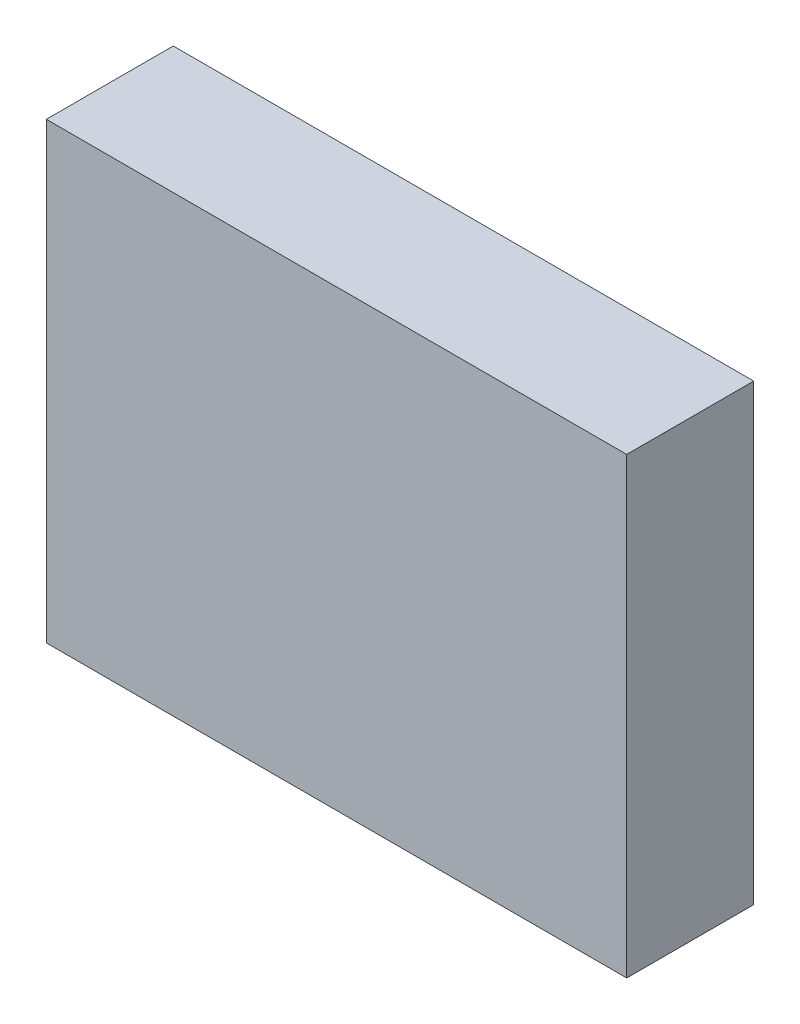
ISO-10303-21;
HEADER;
FILE_DESCRIPTION(('STEP AP214'),'2;1');
FILE_NAME('part.step','',(''),(''),'','','');
FILE_SCHEMA(('AUTOMOTIVE_DESIGN { 1 0 10303 214 1 1 1 1 }'));
ENDSEC;
DATA;
#1=APPLICATION_CONTEXT('core data for automotive mechanical design processes');
#2=APPLICATION_PROTOCOL_DEFINITION('international standard','automotive_design',2000,#1);
#3=PRODUCT_CONTEXT('',#1,'mechanical');
#4=PRODUCT('Part','Part','',(#3));
#5=PRODUCT_RELATED_PRODUCT_CATEGORY('part','',(#4));
#6=PRODUCT_DEFINITION_FORMATION('','',#4);
#7=PRODUCT_DEFINITION_CONTEXT('part definition',#1,'design');
#8=PRODUCT_DEFINITION('design','',#6,#7);
#9=PRODUCT_DEFINITION_SHAPE('','',#8);
#10=(LENGTH_UNIT() NAMED_UNIT(*) SI_UNIT(.MILLI.,.METRE.));
#11=(NAMED_UNIT(*) PLANE_ANGLE_UNIT() SI_UNIT($,.RADIAN.));
#12=(NAMED_UNIT(*) SI_UNIT($,.STERADIAN.) SOLID_ANGLE_UNIT());
#13=UNCERTAINTY_MEASURE_WITH_UNIT(LENGTH_MEASURE(1.E-05),#10,'distance_accuracy_value','');
#14=(GEOMETRIC_REPRESENTATION_CONTEXT(3) GLOBAL_UNCERTAINTY_ASSIGNED_CONTEXT((#13)) GLOBAL_UNIT_ASSIGNED_CONTEXT((#10,
#11,#12)) REPRESENTATION_CONTEXT('',''));
#15=CARTESIAN_POINT('',(0.,0.,0.));
#16=DIRECTION('',(0.,0.,1.));
#17=DIRECTION('',(1.,0.,0.));
#18=AXIS2_PLACEMENT_3D('',#15,#16,#17);
#19=CARTESIAN_POINT('',(0.,0.,0.70000114));
#20=DIRECTION('',(0.,0.,-1.));
#21=DIRECTION('',(0.,-1.,0.));
#22=AXIS2_PLACEMENT_3D('',#19,#20,#21);
#23=PLANE('',#22);
#24=DIRECTION('',(1.,0.,0.));
#25=VECTOR('',#24,1.);
#26=CARTESIAN_POINT('',(-1.59999934,1.25000004,0.70000114));
#27=LINE('',#26,#25);
#28=CARTESIAN_POINT('',(-1.59999934,1.25000004,0.70000114));
#29=VERTEX_POINT('',#28);
#30=CARTESIAN_POINT('',(1.59999934,1.25000004,0.70000114));
#31=VERTEX_POINT('',#30);
#32=EDGE_CURVE('E21',#29,#31,#27,.T.);
#33=ORIENTED_EDGE('',*,*,#32,.F.);
#34=DIRECTION('',(0.,1.,0.));
#35=VECTOR('',#34,1.);
#36=CARTESIAN_POINT('',(-1.59999934,-1.25000004,0.70000114));
#37=LINE('',#36,#35);
#38=CARTESIAN_POINT('',(-1.59999934,-1.25000004,0.70000114));
#39=VERTEX_POINT('',#38);
#40=EDGE_CURVE('E69',#39,#29,#37,.T.);
#41=ORIENTED_EDGE('',*,*,#40,.F.);
#42=DIRECTION('',(-1.,0.,0.));
#43=VECTOR('',#42,1.);
#44=CARTESIAN_POINT('',(1.59999934,-1.25000004,0.70000114));
#45=LINE('',#44,#43);
#46=CARTESIAN_POINT('',(1.59999934,-1.25000004,0.70000114));
#47=VERTEX_POINT('',#46);
#48=EDGE_CURVE('E72',#47,#39,#45,.T.);
#49=ORIENTED_EDGE('',*,*,#48,.F.);
#50=DIRECTION('',(0.,-1.,0.));
#51=VECTOR('',#50,1.);
#52=CARTESIAN_POINT('',(1.59999934,1.25000004,0.70000114));
#53=LINE('',#52,#51);
#54=EDGE_CURVE('E116',#31,#47,#53,.T.);
#55=ORIENTED_EDGE('',*,*,#54,.F.);
#56=EDGE_LOOP('',(#33,#41,#49,#55));
#57=FACE_BOUND('',#56,.T.);
#58=ADVANCED_FACE('F17',(#57),#23,.F.);
#59=CARTESIAN_POINT('',(0.,0.,0.));
#60=DIRECTION('',(0.,0.,-1.));
#61=DIRECTION('',(0.,-1.,0.));
#62=AXIS2_PLACEMENT_3D('',#59,#60,#61);
#63=PLANE('',#62);
#64=DIRECTION('',(0.,-1.,0.));
#65=VECTOR('',#64,1.);
#66=CARTESIAN_POINT('',(1.59999934,1.25000004,0.));
#67=LINE('',#66,#65);
#68=CARTESIAN_POINT('',(1.59999934,1.25000004,0.));
#69=VERTEX_POINT('',#68);
#70=CARTESIAN_POINT('',(1.59999934,-1.25000004,0.));
#71=VERTEX_POINT('',#70);
#72=EDGE_CURVE('E93',#69,#71,#67,.T.);
#73=ORIENTED_EDGE('',*,*,#72,.T.);
#74=DIRECTION('',(-1.,0.,0.));
#75=VECTOR('',#74,1.);
#76=CARTESIAN_POINT('',(1.59999934,-1.25000004,0.));
#77=LINE('',#76,#75);
#78=CARTESIAN_POINT('',(-1.59999934,-1.25000004,0.));
#79=VERTEX_POINT('',#78);
#80=EDGE_CURVE('E78',#71,#79,#77,.T.);
#81=ORIENTED_EDGE('',*,*,#80,.T.);
#82=DIRECTION('',(0.,1.,0.));
#83=VECTOR('',#82,1.);
#84=CARTESIAN_POINT('',(-1.59999934,-1.25000004,0.));
#85=LINE('',#84,#83);
#86=CARTESIAN_POINT('',(-1.59999934,1.25000004,0.));
#87=VERTEX_POINT('',#86);
#88=EDGE_CURVE('E83',#79,#87,#85,.T.);
#89=ORIENTED_EDGE('',*,*,#88,.T.);
#90=DIRECTION('',(1.,0.,0.));
#91=VECTOR('',#90,1.);
#92=CARTESIAN_POINT('',(-1.59999934,1.25000004,0.));
#93=LINE('',#92,#91);
#94=EDGE_CURVE('E11',#87,#69,#93,.T.);
#95=ORIENTED_EDGE('',*,*,#94,.T.);
#96=EDGE_LOOP('',(#73,#81,#89,#95));
#97=FACE_BOUND('',#96,.T.);
#98=ADVANCED_FACE('F19',(#97),#63,.T.);
#99=CARTESIAN_POINT('',(-1.59999934,1.25000004,0.));
#100=DIRECTION('',(0.,1.,0.));
#101=DIRECTION('',(1.,0.,0.));
#102=AXIS2_PLACEMENT_3D('',#99,#100,#101);
#103=PLANE('',#102);
#104=DIRECTION('',(0.,0.,1.));
#105=VECTOR('',#104,1.);
#106=CARTESIAN_POINT('',(-1.59999934,1.25000004,0.));
#107=LINE('',#106,#105);
#108=EDGE_CURVE('E77',#87,#29,#107,.T.);
#109=ORIENTED_EDGE('',*,*,#108,.T.);
#110=ORIENTED_EDGE('',*,*,#32,.T.);
#111=DIRECTION('',(0.,0.,1.));
#112=VECTOR('',#111,1.);
#113=CARTESIAN_POINT('',(1.59999934,1.25000004,0.));
#114=LINE('',#113,#112);
#115=EDGE_CURVE('E115',#69,#31,#114,.T.);
#116=ORIENTED_EDGE('',*,*,#115,.F.);
#117=ORIENTED_EDGE('',*,*,#94,.F.);
#118=EDGE_LOOP('',(#109,#110,#116,#117));
#119=FACE_BOUND('',#118,.T.);
#120=ADVANCED_FACE('F113',(#119),#103,.T.);
#121=CARTESIAN_POINT('',(-1.59999934,-1.25000004,0.));
#122=DIRECTION('',(-1.,0.,0.));
#123=DIRECTION('',(0.,0.,1.));
#124=AXIS2_PLACEMENT_3D('',#121,#122,#123);
#125=PLANE('',#124);
#126=DIRECTION('',(0.,0.,1.));
#127=VECTOR('',#126,1.);
#128=CARTESIAN_POINT('',(-1.59999934,-1.25000004,0.));
#129=LINE('',#128,#127);
#130=EDGE_CURVE('E81',#79,#39,#129,.T.);
#131=ORIENTED_EDGE('',*,*,#130,.T.);
#132=ORIENTED_EDGE('',*,*,#40,.T.);
#133=ORIENTED_EDGE('',*,*,#108,.F.);
#134=ORIENTED_EDGE('',*,*,#88,.F.);
#135=EDGE_LOOP('',(#131,#132,#133,#134));
#136=FACE_BOUND('',#135,.T.);
#137=ADVANCED_FACE('F82',(#136),#125,.T.);
#138=CARTESIAN_POINT('',(1.59999934,-1.25000004,0.));
#139=DIRECTION('',(0.,-1.,0.));
#140=DIRECTION('',(0.,0.,-1.));
#141=AXIS2_PLACEMENT_3D('',#138,#139,#140);
#142=PLANE('',#141);
#143=DIRECTION('',(0.,0.,1.));
#144=VECTOR('',#143,1.);
#145=CARTESIAN_POINT('',(1.59999934,-1.25000004,0.));
#146=LINE('',#145,#144);
#147=EDGE_CURVE('E90',#71,#47,#146,.T.);
#148=ORIENTED_EDGE('',*,*,#147,.T.);
#149=ORIENTED_EDGE('',*,*,#48,.T.);
#150=ORIENTED_EDGE('',*,*,#130,.F.);
#151=ORIENTED_EDGE('',*,*,#80,.F.);
#152=EDGE_LOOP('',(#148,#149,#150,#151));
#153=FACE_BOUND('',#152,.T.);
#154=ADVANCED_FACE('F88',(#153),#142,.T.);
#155=CARTESIAN_POINT('',(1.59999934,1.25000004,0.));
#156=DIRECTION('',(1.,0.,0.));
#157=DIRECTION('',(0.,1.,0.));
#158=AXIS2_PLACEMENT_3D('',#155,#156,#157);
#159=PLANE('',#158);
#160=ORIENTED_EDGE('',*,*,#115,.T.);
#161=ORIENTED_EDGE('',*,*,#54,.T.);
#162=ORIENTED_EDGE('',*,*,#147,.F.);
#163=ORIENTED_EDGE('',*,*,#72,.F.);
#164=EDGE_LOOP('',(#160,#161,#162,#163));
#165=FACE_BOUND('',#164,.T.);
#166=ADVANCED_FACE('F121',(#165),#159,.T.);
#167=CLOSED_SHELL('',(#58,#98,#120,#137,#154,#166));
#168=MANIFOLD_SOLID_BREP('B1',#167);
#169=ADVANCED_BREP_SHAPE_REPRESENTATION('',(#18,#168),#14);
#170=SHAPE_DEFINITION_REPRESENTATION(#9,#169);
ENDSEC;
END-ISO-10303-21;
